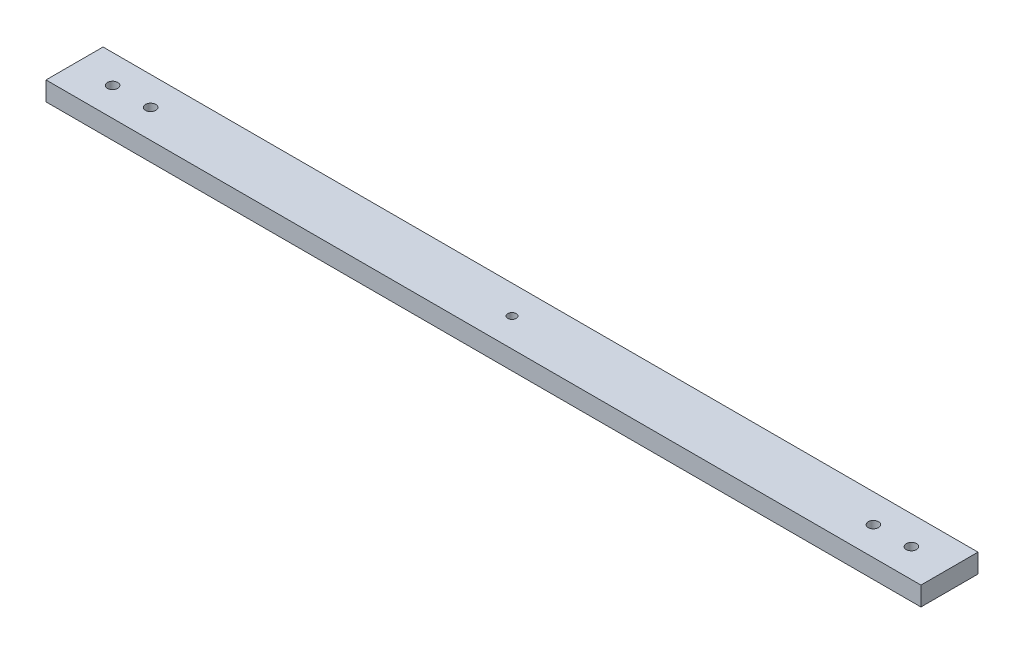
from build123d import *

# Parameters (mm, degrees)
SKETCH2_W             = 292.1
SKETCH2_H             = 19.05
BOSS_EXTRUDE1_DEPTH   = 6.35
F_8_32_TAPPED_HOLE1_D = 3.4544
F_4_40_TAPPED_HOLE1_D = 2.8448


with BuildPart() as part:
    # Sketch2 → Boss-Extrude1 (new body)
    with BuildSketch(Plane(origin=(0, 0, 0), x_dir=(1, 0, 0), z_dir=(0, 1, 0))):
        with Locations((0, -3.175)):
            Rectangle(SKETCH2_W, SKETCH2_H)
    extrude(amount=BOSS_EXTRUDE1_DEPTH)

    # 8-32 Tapped Hole1 (through all)
    with Locations(Plane(origin=(0, 6.35, 0), x_dir=(1, 0, 0), z_dir=(0, 1, 0))):
        with Locations((-133.35, -3.175), (-120.65, -3.175)):
            f_8_32_tapped_hole1 = Hole(F_8_32_TAPPED_HOLE1_D / 2)

    # Mirror1: 8-32 Tapped Hole1 across plane
    add(f_8_32_tapped_hole1.mirror(Plane(origin=(0, 0, 0), x_dir=(0, 0, 1), z_dir=(1, 0, 0))), mode=Mode.SUBTRACT)

    # 4-40 Tapped Hole1 (through all)
    with Locations(Plane(origin=(0, 6.35, 0), x_dir=(1, 0, 0), z_dir=(0, 1, 0))):
        with Locations((0, -3.175)):
            Hole(F_4_40_TAPPED_HOLE1_D / 2)


solid = part.part
